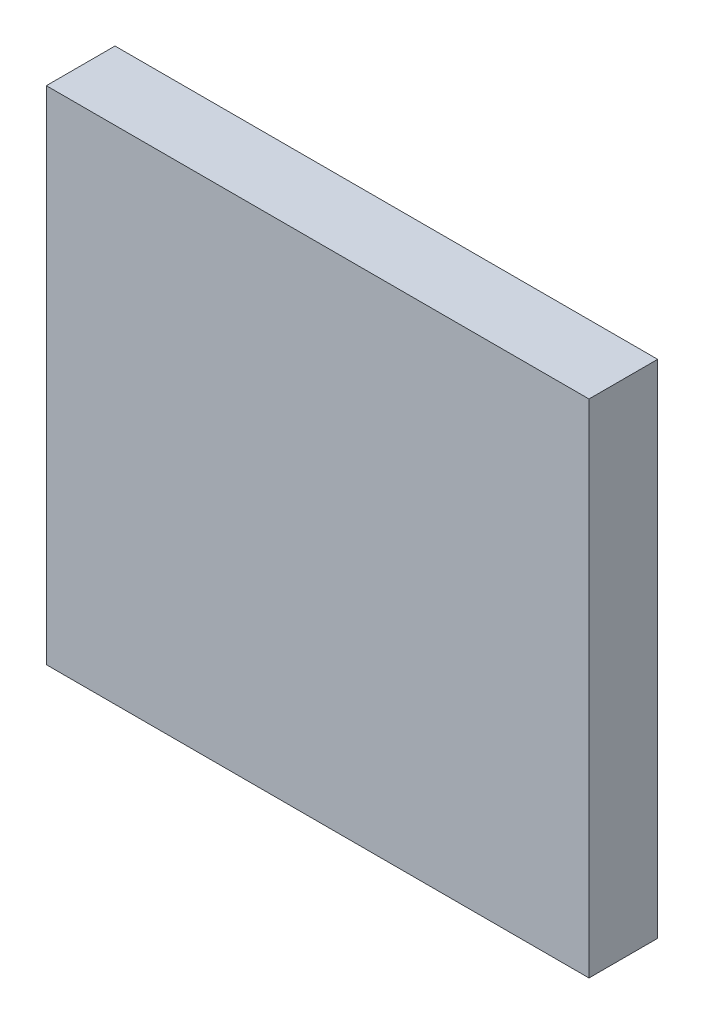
ISO-10303-21;
HEADER;
FILE_DESCRIPTION(('STEP AP214'),'2;1');
FILE_NAME('part.step','',(''),(''),'','','');
FILE_SCHEMA(('AUTOMOTIVE_DESIGN { 1 0 10303 214 1 1 1 1 }'));
ENDSEC;
DATA;
#1=APPLICATION_CONTEXT('core data for automotive mechanical design processes');
#2=APPLICATION_PROTOCOL_DEFINITION('international standard','automotive_design',2000,#1);
#3=PRODUCT_CONTEXT('',#1,'mechanical');
#4=PRODUCT('Part','Part','',(#3));
#5=PRODUCT_RELATED_PRODUCT_CATEGORY('part','',(#4));
#6=PRODUCT_DEFINITION_FORMATION('','',#4);
#7=PRODUCT_DEFINITION_CONTEXT('part definition',#1,'design');
#8=PRODUCT_DEFINITION('design','',#6,#7);
#9=PRODUCT_DEFINITION_SHAPE('','',#8);
#10=(LENGTH_UNIT() NAMED_UNIT(*) SI_UNIT(.MILLI.,.METRE.));
#11=(NAMED_UNIT(*) PLANE_ANGLE_UNIT() SI_UNIT($,.RADIAN.));
#12=(NAMED_UNIT(*) SI_UNIT($,.STERADIAN.) SOLID_ANGLE_UNIT());
#13=UNCERTAINTY_MEASURE_WITH_UNIT(LENGTH_MEASURE(1.E-05),#10,'distance_accuracy_value','');
#14=(GEOMETRIC_REPRESENTATION_CONTEXT(3) GLOBAL_UNCERTAINTY_ASSIGNED_CONTEXT((#13)) GLOBAL_UNIT_ASSIGNED_CONTEXT((#10,
#11,#12)) REPRESENTATION_CONTEXT('',''));
#15=CARTESIAN_POINT('',(0.,0.,0.));
#16=DIRECTION('',(0.,0.,1.));
#17=DIRECTION('',(1.,0.,0.));
#18=AXIS2_PLACEMENT_3D('',#15,#16,#17);
#19=CARTESIAN_POINT('',(0.,0.,1.00000054));
#20=DIRECTION('',(0.,0.,-1.));
#21=DIRECTION('',(0.,-1.,0.));
#22=AXIS2_PLACEMENT_3D('',#19,#20,#21);
#23=PLANE('',#22);
#24=DIRECTION('',(0.,-1.,0.));
#25=VECTOR('',#24,1.);
#26=CARTESIAN_POINT('',(3.94999972,3.65000032,1.00000054));
#27=LINE('',#26,#25);
#28=CARTESIAN_POINT('',(3.94999972,3.65000032,1.00000054));
#29=VERTEX_POINT('',#28);
#30=CARTESIAN_POINT('',(3.94999972,-3.65000032,1.00000054));
#31=VERTEX_POINT('',#30);
#32=EDGE_CURVE('E21',#29,#31,#27,.T.);
#33=ORIENTED_EDGE('',*,*,#32,.F.);
#34=DIRECTION('',(1.,0.,0.));
#35=VECTOR('',#34,1.);
#36=CARTESIAN_POINT('',(-3.94999972,3.65000032,1.00000054));
#37=LINE('',#36,#35);
#38=CARTESIAN_POINT('',(-3.94999972,3.65000032,1.00000054));
#39=VERTEX_POINT('',#38);
#40=EDGE_CURVE('E68',#39,#29,#37,.T.);
#41=ORIENTED_EDGE('',*,*,#40,.F.);
#42=DIRECTION('',(0.,1.,0.));
#43=VECTOR('',#42,1.);
#44=CARTESIAN_POINT('',(-3.94999972,-3.65000032,1.00000054));
#45=LINE('',#44,#43);
#46=CARTESIAN_POINT('',(-3.94999972,-3.65000032,1.00000054));
#47=VERTEX_POINT('',#46);
#48=EDGE_CURVE('E71',#47,#39,#45,.T.);
#49=ORIENTED_EDGE('',*,*,#48,.F.);
#50=DIRECTION('',(-1.,0.,0.));
#51=VECTOR('',#50,1.);
#52=CARTESIAN_POINT('',(3.94999972,-3.65000032,1.00000054));
#53=LINE('',#52,#51);
#54=EDGE_CURVE('E115',#31,#47,#53,.T.);
#55=ORIENTED_EDGE('',*,*,#54,.F.);
#56=EDGE_LOOP('',(#33,#41,#49,#55));
#57=FACE_BOUND('',#56,.T.);
#58=ADVANCED_FACE('F17',(#57),#23,.F.);
#59=CARTESIAN_POINT('',(0.,0.,0.));
#60=DIRECTION('',(0.,0.,-1.));
#61=DIRECTION('',(0.,-1.,0.));
#62=AXIS2_PLACEMENT_3D('',#59,#60,#61);
#63=PLANE('',#62);
#64=DIRECTION('',(-1.,0.,0.));
#65=VECTOR('',#64,1.);
#66=CARTESIAN_POINT('',(3.94999972,-3.65000032,0.));
#67=LINE('',#66,#65);
#68=CARTESIAN_POINT('',(3.94999972,-3.65000032,0.));
#69=VERTEX_POINT('',#68);
#70=CARTESIAN_POINT('',(-3.94999972,-3.65000032,0.));
#71=VERTEX_POINT('',#70);
#72=EDGE_CURVE('E92',#69,#71,#67,.T.);
#73=ORIENTED_EDGE('',*,*,#72,.T.);
#74=DIRECTION('',(0.,1.,0.));
#75=VECTOR('',#74,1.);
#76=CARTESIAN_POINT('',(-3.94999972,-3.65000032,0.));
#77=LINE('',#76,#75);
#78=CARTESIAN_POINT('',(-3.94999972,3.65000032,0.));
#79=VERTEX_POINT('',#78);
#80=EDGE_CURVE('E77',#71,#79,#77,.T.);
#81=ORIENTED_EDGE('',*,*,#80,.T.);
#82=DIRECTION('',(1.,0.,0.));
#83=VECTOR('',#82,1.);
#84=CARTESIAN_POINT('',(-3.94999972,3.65000032,0.));
#85=LINE('',#84,#83);
#86=CARTESIAN_POINT('',(3.94999972,3.65000032,0.));
#87=VERTEX_POINT('',#86);
#88=EDGE_CURVE('E82',#79,#87,#85,.T.);
#89=ORIENTED_EDGE('',*,*,#88,.T.);
#90=DIRECTION('',(0.,-1.,0.));
#91=VECTOR('',#90,1.);
#92=CARTESIAN_POINT('',(3.94999972,3.65000032,0.));
#93=LINE('',#92,#91);
#94=EDGE_CURVE('E11',#87,#69,#93,.T.);
#95=ORIENTED_EDGE('',*,*,#94,.T.);
#96=EDGE_LOOP('',(#73,#81,#89,#95));
#97=FACE_BOUND('',#96,.T.);
#98=ADVANCED_FACE('F19',(#97),#63,.T.);
#99=CARTESIAN_POINT('',(3.94999972,3.65000032,0.));
#100=DIRECTION('',(1.,0.,0.));
#101=DIRECTION('',(0.,1.,0.));
#102=AXIS2_PLACEMENT_3D('',#99,#100,#101);
#103=PLANE('',#102);
#104=DIRECTION('',(0.,0.,1.));
#105=VECTOR('',#104,1.);
#106=CARTESIAN_POINT('',(3.94999972,3.65000032,0.));
#107=LINE('',#106,#105);
#108=EDGE_CURVE('E76',#87,#29,#107,.T.);
#109=ORIENTED_EDGE('',*,*,#108,.T.);
#110=ORIENTED_EDGE('',*,*,#32,.T.);
#111=DIRECTION('',(0.,0.,1.));
#112=VECTOR('',#111,1.);
#113=CARTESIAN_POINT('',(3.94999972,-3.65000032,0.));
#114=LINE('',#113,#112);
#115=EDGE_CURVE('E114',#69,#31,#114,.T.);
#116=ORIENTED_EDGE('',*,*,#115,.F.);
#117=ORIENTED_EDGE('',*,*,#94,.F.);
#118=EDGE_LOOP('',(#109,#110,#116,#117));
#119=FACE_BOUND('',#118,.T.);
#120=ADVANCED_FACE('F112',(#119),#103,.T.);
#121=CARTESIAN_POINT('',(-3.94999972,3.65000032,0.));
#122=DIRECTION('',(0.,1.,0.));
#123=DIRECTION('',(1.,0.,0.));
#124=AXIS2_PLACEMENT_3D('',#121,#122,#123);
#125=PLANE('',#124);
#126=DIRECTION('',(0.,0.,1.));
#127=VECTOR('',#126,1.);
#128=CARTESIAN_POINT('',(-3.94999972,3.65000032,0.));
#129=LINE('',#128,#127);
#130=EDGE_CURVE('E80',#79,#39,#129,.T.);
#131=ORIENTED_EDGE('',*,*,#130,.T.);
#132=ORIENTED_EDGE('',*,*,#40,.T.);
#133=ORIENTED_EDGE('',*,*,#108,.F.);
#134=ORIENTED_EDGE('',*,*,#88,.F.);
#135=EDGE_LOOP('',(#131,#132,#133,#134));
#136=FACE_BOUND('',#135,.T.);
#137=ADVANCED_FACE('F81',(#136),#125,.T.);
#138=CARTESIAN_POINT('',(-3.94999972,-3.65000032,0.));
#139=DIRECTION('',(-1.,0.,0.));
#140=DIRECTION('',(0.,0.,1.));
#141=AXIS2_PLACEMENT_3D('',#138,#139,#140);
#142=PLANE('',#141);
#143=DIRECTION('',(0.,0.,1.));
#144=VECTOR('',#143,1.);
#145=CARTESIAN_POINT('',(-3.94999972,-3.65000032,0.));
#146=LINE('',#145,#144);
#147=EDGE_CURVE('E89',#71,#47,#146,.T.);
#148=ORIENTED_EDGE('',*,*,#147,.T.);
#149=ORIENTED_EDGE('',*,*,#48,.T.);
#150=ORIENTED_EDGE('',*,*,#130,.F.);
#151=ORIENTED_EDGE('',*,*,#80,.F.);
#152=EDGE_LOOP('',(#148,#149,#150,#151));
#153=FACE_BOUND('',#152,.T.);
#154=ADVANCED_FACE('F87',(#153),#142,.T.);
#155=CARTESIAN_POINT('',(3.94999972,-3.65000032,0.));
#156=DIRECTION('',(0.,-1.,0.));
#157=DIRECTION('',(0.,0.,-1.));
#158=AXIS2_PLACEMENT_3D('',#155,#156,#157);
#159=PLANE('',#158);
#160=ORIENTED_EDGE('',*,*,#115,.T.);
#161=ORIENTED_EDGE('',*,*,#54,.T.);
#162=ORIENTED_EDGE('',*,*,#147,.F.);
#163=ORIENTED_EDGE('',*,*,#72,.F.);
#164=EDGE_LOOP('',(#160,#161,#162,#163));
#165=FACE_BOUND('',#164,.T.);
#166=ADVANCED_FACE('F120',(#165),#159,.T.);
#167=CLOSED_SHELL('',(#58,#98,#120,#137,#154,#166));
#168=MANIFOLD_SOLID_BREP('B1',#167);
#169=ADVANCED_BREP_SHAPE_REPRESENTATION('',(#18,#168),#14);
#170=SHAPE_DEFINITION_REPRESENTATION(#9,#169);
ENDSEC;
END-ISO-10303-21;
